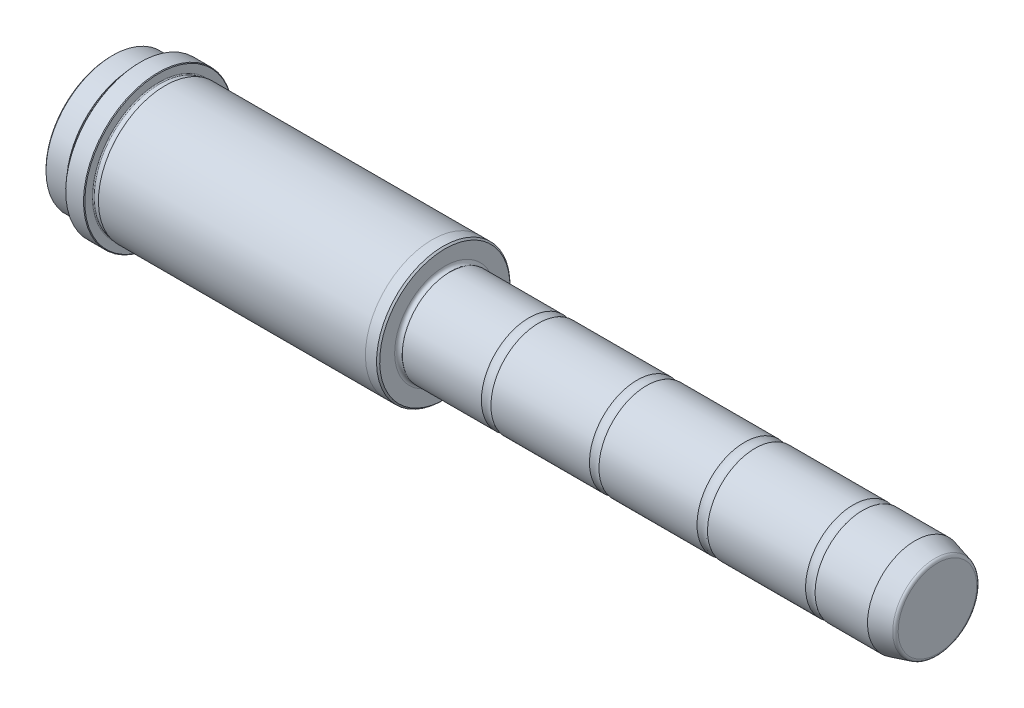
from build123d import *

# Parameters (mm, degrees)
FILLET1_R     = 1
CHAMFER1_SIZE = 0.2
CHAMFER2_SIZE = 0.5


with BuildPart() as part:
    # Sketch1 → Revolve1 (revolve)
    with BuildSketch(Plane.XY):
        with BuildLine():
            Line((155, 13.124355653), (148, 15))
            Line((148, 15), (1.6, 15))
            ThreePointArc((1.6, 15), (0.552786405, 14.905572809), (0, 15.8))
            Line((0, 15.8), (0, 21))
            Line((0, 21), (-4, 21))
            Line((-4, 21), (-88, 21.0001))
            Line((-88, 21.0001), (-88, 20.9))
            ThreePointArc((-88, 20.9), (-88.087867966, 20.687867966), (-88.3, 20.6))
            Line((-88.3, 20.6), (-89.7, 20.6))
            ThreePointArc((-89.7, 20.6), (-89.912132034, 20.687867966), (-90, 20.9))
            Line((-90, 20.9), (-90, 23.5))
            Line((-90, 23.5), (-96, 23.5))
            Line((-96, 23.5), (-96, 20.9))
            ThreePointArc((-96, 20.9), (-96.087867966, 20.687867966), (-96.3, 20.6))
            Line((-96.3, 20.6), (-97.7, 20.6))
            ThreePointArc((-97.7, 20.6), (-97.912132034, 20.687867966), (-98, 20.9))
            Line((-98, 20.9), (-98, 21))
            Line((-98, 21), (-105, 21))
            Line((-105, 21), (-105, 0))
            Line((-105, 0), (155, 0))
            Line((155, 0), (155, 13.124355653))
        make_face()
    revolve(axis=Axis((155, 0, 0), (-1, 0, 0)))

    # Sketch2 → Groove A (revolve, cut)
    with BuildSketch(Plane.XY):
        with BuildLine():
            Line((128.503337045, 15), (131.496662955, 15))
            ThreePointArc((131.496662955, 15), (130, 14.6), (128.503337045, 15))
        make_face()
    revolve(axis=Axis((155, 0, 0), (1, 0, 0)), mode=Mode.SUBTRACT)

    # Sketch3 → Groove B (revolve, cut)
    with BuildSketch(Plane.XY, mode=Mode.PRIVATE) as groove_b_sk:
        with BuildLine():
            Line((94.341687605, 15), (97.658312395, 15))
            ThreePointArc((97.658312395, 15), (96, 14.5), (94.341687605, 15))
        make_face()
    revolve(groove_b_sk.sketch.rotate(Axis((155, 0, 0), (1, 0, 0)), 180), axis=Axis((155, 0, 0), (1, 0, 0)), mode=Mode.SUBTRACT)

    # Sketch4 → Groove C (revolve, cut)
    with BuildSketch(Plane.XY, mode=Mode.PRIVATE) as groove_c_sk:
        with BuildLine():
            Line((60.503337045, 15), (63.496662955, 15))
            ThreePointArc((63.496662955, 15), (62, 14.6), (60.503337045, 15))
        make_face()
    revolve(groove_c_sk.sketch.rotate(Axis((155, 0, 0), (1, 0, 0)), 180), axis=Axis((155, 0, 0), (1, 0, 0)), mode=Mode.SUBTRACT)

    # Sketch5 → Groove D (revolve, cut)
    with BuildSketch(Plane.XY, mode=Mode.PRIVATE) as groove_d_sk:
        with BuildLine():
            Line((26.503337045, 15), (29.496662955, 15))
            ThreePointArc((29.496662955, 15), (28, 14.6), (26.503337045, 15))
        make_face()
    revolve(groove_d_sk.sketch.rotate(Axis((155, 0, 0), (1, 0, 0)), 180), axis=Axis((155, 0, 0), (1, 0, 0)), mode=Mode.SUBTRACT)

    # Fillet1
    fillet1_edges = [part.edges().sort_by_distance(p)[0] for p in [
        (155, -13.124355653, 0),
    ]]
    fillet(fillet1_edges, radius=FILLET1_R)

    # Chamfer1
    chamfer1_edges = [part.edges().sort_by_distance(p)[0] for p in [
        (-90, -23.5, 0),
        (-96, -23.5, 0),
    ]]
    chamfer(chamfer1_edges, length=CHAMFER1_SIZE)

    # Chamfer2
    chamfer2_edges = [part.edges().sort_by_distance(p)[0] for p in [
        (0, -21, 0),
        (-105, -21, 0),
    ]]
    chamfer(chamfer2_edges, length=CHAMFER2_SIZE)


solid = part.part
